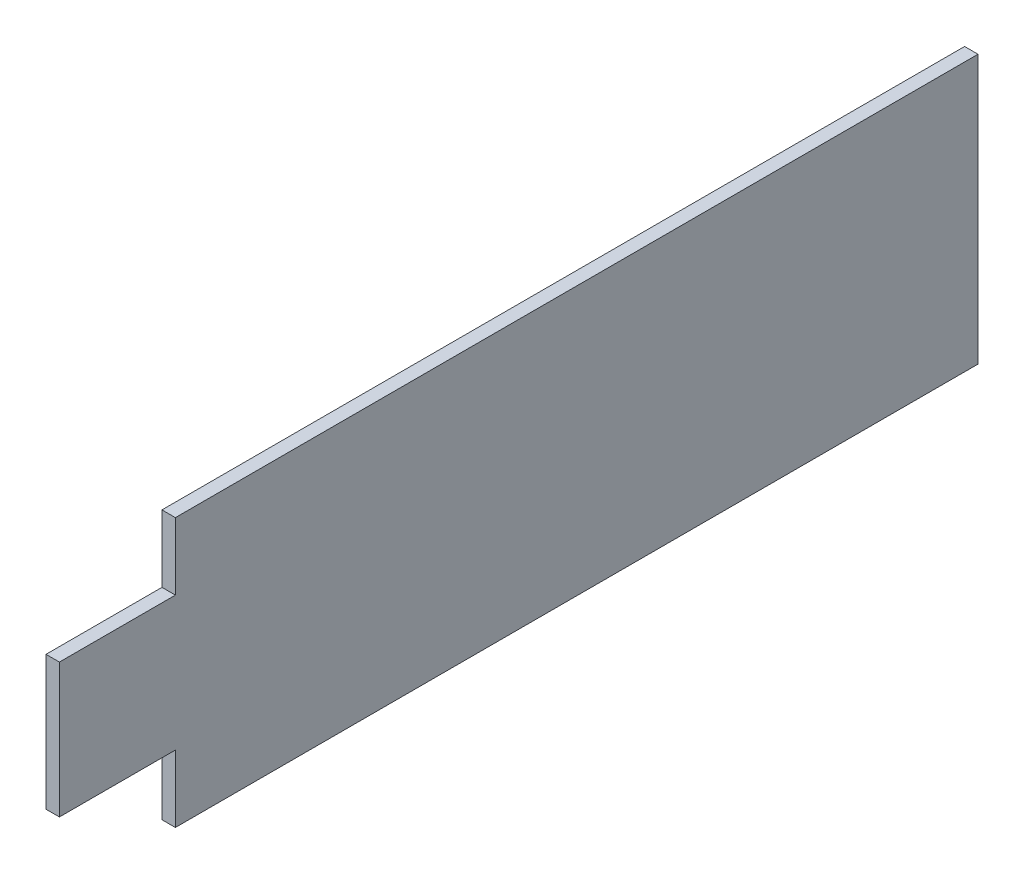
from build123d import *

# Parameters (mm, degrees)
BOSS_EXTRUDE1_DEPTH = 1
CUT_EXTRUDE1_DEPTH  = 153.622489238


with BuildPart() as part:
    # Sketch1 → Boss-Extrude1 (new, symmetric)
    with BuildSketch(Plane(origin=(0, 0, 0), x_dir=(0, 0, -1), z_dir=(1, 0, 0))):
        Polygon((147.284161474, 20), (147.284161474, -20), (17.284161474, -20), (17.284161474, -10), (0, -10), (0, 10), (17.284161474, 10), (17.284161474, 20), align=None)
    extrude(amount=BOSS_EXTRUDE1_DEPTH, both=True)

    # Sketch2 → Cut-Extrude1 (cut, through all)
    with BuildSketch(Plane(origin=(0, 20, 0), x_dir=(1, 0, 0), z_dir=(0, 1, 0))):
        with BuildLine():
            Line((1, 197.213788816), (1, 136.911817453))
            ThreePointArc((1, 136.911817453), (0, 136.914163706), (-1, 136.911817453))
            Line((-1, 136.911817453), (-1, 197.213788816))
            Line((-1, 197.213788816), (1, 197.213788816))
        make_face()
    extrude(amount=-CUT_EXTRUDE1_DEPTH, mode=Mode.SUBTRACT)


solid = part.part
